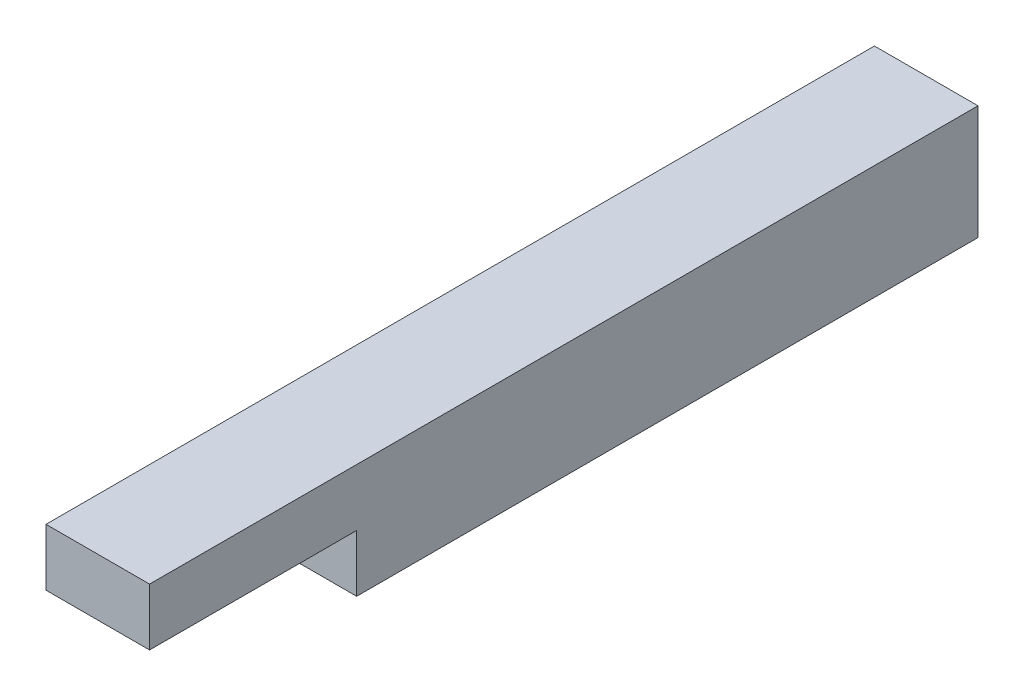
ISO-10303-21;
HEADER;
FILE_DESCRIPTION(('STEP AP214'),'2;1');
FILE_NAME('part.step','',(''),(''),'','','');
FILE_SCHEMA(('AUTOMOTIVE_DESIGN { 1 0 10303 214 1 1 1 1 }'));
ENDSEC;
DATA;
#1=APPLICATION_CONTEXT('core data for automotive mechanical design processes');
#2=APPLICATION_PROTOCOL_DEFINITION('international standard','automotive_design',2000,#1);
#3=PRODUCT_CONTEXT('',#1,'mechanical');
#4=PRODUCT('Part','Part','',(#3));
#5=PRODUCT_RELATED_PRODUCT_CATEGORY('part','',(#4));
#6=PRODUCT_DEFINITION_FORMATION('','',#4);
#7=PRODUCT_DEFINITION_CONTEXT('part definition',#1,'design');
#8=PRODUCT_DEFINITION('design','',#6,#7);
#9=PRODUCT_DEFINITION_SHAPE('','',#8);
#10=(LENGTH_UNIT() NAMED_UNIT(*) SI_UNIT(.MILLI.,.METRE.));
#11=(NAMED_UNIT(*) PLANE_ANGLE_UNIT() SI_UNIT($,.RADIAN.));
#12=(NAMED_UNIT(*) SI_UNIT($,.STERADIAN.) SOLID_ANGLE_UNIT());
#13=UNCERTAINTY_MEASURE_WITH_UNIT(LENGTH_MEASURE(1.E-05),#10,'distance_accuracy_value','');
#14=(GEOMETRIC_REPRESENTATION_CONTEXT(3) GLOBAL_UNCERTAINTY_ASSIGNED_CONTEXT((#13)) GLOBAL_UNIT_ASSIGNED_CONTEXT((#10,
#11,#12)) REPRESENTATION_CONTEXT('',''));
#15=CARTESIAN_POINT('',(0.,0.,0.));
#16=DIRECTION('',(0.,0.,1.));
#17=DIRECTION('',(1.,0.,0.));
#18=AXIS2_PLACEMENT_3D('',#15,#16,#17);
#19=CARTESIAN_POINT('',(6.35,0.,0.));
#20=DIRECTION('',(0.,0.,1.));
#21=DIRECTION('',(1.,0.,0.));
#22=AXIS2_PLACEMENT_3D('',#19,#20,#21);
#23=PLANE('',#22);
#24=DIRECTION('',(0.,1.,0.));
#25=VECTOR('',#24,1.);
#26=CARTESIAN_POINT('',(0.,0.,0.));
#27=LINE('',#26,#25);
#28=CARTESIAN_POINT('',(0.,0.,0.));
#29=VERTEX_POINT('',#28);
#30=CARTESIAN_POINT('',(0.,7.,0.));
#31=VERTEX_POINT('',#30);
#32=EDGE_CURVE('E117',#29,#31,#27,.T.);
#33=ORIENTED_EDGE('',*,*,#32,.T.);
#34=DIRECTION('',(-1.,0.,0.));
#35=VECTOR('',#34,1.);
#36=CARTESIAN_POINT('',(6.35,7.,0.));
#37=LINE('',#36,#35);
#38=CARTESIAN_POINT('',(6.35,7.,0.));
#39=VERTEX_POINT('',#38);
#40=EDGE_CURVE('E11',#39,#31,#37,.T.);
#41=ORIENTED_EDGE('',*,*,#40,.F.);
#42=DIRECTION('',(0.,1.,0.));
#43=VECTOR('',#42,1.);
#44=CARTESIAN_POINT('',(6.35,0.,0.));
#45=LINE('',#44,#43);
#46=CARTESIAN_POINT('',(6.35,0.,0.));
#47=VERTEX_POINT('',#46);
#48=EDGE_CURVE('E127',#47,#39,#45,.T.);
#49=ORIENTED_EDGE('',*,*,#48,.F.);
#50=DIRECTION('',(-1.,0.,0.));
#51=VECTOR('',#50,1.);
#52=CARTESIAN_POINT('',(6.35,0.,0.));
#53=LINE('',#52,#51);
#54=EDGE_CURVE('E113',#47,#29,#53,.T.);
#55=ORIENTED_EDGE('',*,*,#54,.T.);
#56=EDGE_LOOP('',(#33,#41,#49,#55));
#57=FACE_BOUND('',#56,.T.);
#58=ADVANCED_FACE('F33',(#57),#23,.F.);
#59=CARTESIAN_POINT('',(6.35,7.,50.8));
#60=DIRECTION('',(0.,-1.,0.));
#61=DIRECTION('',(0.,0.,-1.));
#62=AXIS2_PLACEMENT_3D('',#59,#60,#61);
#63=PLANE('',#62);
#64=DIRECTION('',(0.,0.,1.));
#65=VECTOR('',#64,1.);
#66=CARTESIAN_POINT('',(0.,7.,50.8));
#67=LINE('',#66,#65);
#68=CARTESIAN_POINT('',(0.,7.,50.8));
#69=VERTEX_POINT('',#68);
#70=EDGE_CURVE('E120',#31,#69,#67,.T.);
#71=ORIENTED_EDGE('',*,*,#70,.T.);
#72=DIRECTION('',(-1.,0.,0.));
#73=VECTOR('',#72,1.);
#74=CARTESIAN_POINT('',(6.35,7.,50.8));
#75=LINE('',#74,#73);
#76=CARTESIAN_POINT('',(6.35,7.,50.8));
#77=VERTEX_POINT('',#76);
#78=EDGE_CURVE('E41',#77,#69,#75,.T.);
#79=ORIENTED_EDGE('',*,*,#78,.F.);
#80=DIRECTION('',(0.,0.,1.));
#81=VECTOR('',#80,1.);
#82=CARTESIAN_POINT('',(6.35,7.,50.8));
#83=LINE('',#82,#81);
#84=EDGE_CURVE('E86',#39,#77,#83,.T.);
#85=ORIENTED_EDGE('',*,*,#84,.F.);
#86=ORIENTED_EDGE('',*,*,#40,.T.);
#87=EDGE_LOOP('',(#71,#79,#85,#86));
#88=FACE_BOUND('',#87,.T.);
#89=ADVANCED_FACE('F151',(#88),#63,.F.);
#90=CARTESIAN_POINT('',(6.35,7.,50.8));
#91=DIRECTION('',(0.,0.,-1.));
#92=DIRECTION('',(-1.,0.,0.));
#93=AXIS2_PLACEMENT_3D('',#90,#91,#92);
#94=PLANE('',#93);
#95=DIRECTION('',(0.,-1.,0.));
#96=VECTOR('',#95,1.);
#97=CARTESIAN_POINT('',(0.,7.,50.8));
#98=LINE('',#97,#96);
#99=CARTESIAN_POINT('',(0.,3.5,50.8));
#100=VERTEX_POINT('',#99);
#101=EDGE_CURVE('E122',#69,#100,#98,.T.);
#102=ORIENTED_EDGE('',*,*,#101,.T.);
#103=DIRECTION('',(-1.,0.,0.));
#104=VECTOR('',#103,1.);
#105=CARTESIAN_POINT('',(6.35,3.5,50.8));
#106=LINE('',#105,#104);
#107=CARTESIAN_POINT('',(6.35,3.5,50.8));
#108=VERTEX_POINT('',#107);
#109=EDGE_CURVE('E108',#108,#100,#106,.T.);
#110=ORIENTED_EDGE('',*,*,#109,.F.);
#111=DIRECTION('',(0.,-1.,0.));
#112=VECTOR('',#111,1.);
#113=CARTESIAN_POINT('',(6.35,7.,50.8));
#114=LINE('',#113,#112);
#115=EDGE_CURVE('E99',#77,#108,#114,.T.);
#116=ORIENTED_EDGE('',*,*,#115,.F.);
#117=ORIENTED_EDGE('',*,*,#78,.T.);
#118=EDGE_LOOP('',(#102,#110,#116,#117));
#119=FACE_BOUND('',#118,.T.);
#120=ADVANCED_FACE('F133',(#119),#94,.F.);
#121=CARTESIAN_POINT('',(6.35,3.5,50.8));
#122=DIRECTION('',(0.,1.,0.));
#123=DIRECTION('',(0.,0.,1.));
#124=AXIS2_PLACEMENT_3D('',#121,#122,#123);
#125=PLANE('',#124);
#126=DIRECTION('',(0.,0.,-1.));
#127=VECTOR('',#126,1.);
#128=CARTESIAN_POINT('',(0.,3.5,50.8));
#129=LINE('',#128,#127);
#130=CARTESIAN_POINT('',(0.,3.5,38.1));
#131=VERTEX_POINT('',#130);
#132=EDGE_CURVE('E107',#100,#131,#129,.T.);
#133=ORIENTED_EDGE('',*,*,#132,.T.);
#134=DIRECTION('',(-1.,0.,0.));
#135=VECTOR('',#134,1.);
#136=CARTESIAN_POINT('',(6.35,3.5,38.1));
#137=LINE('',#136,#135);
#138=CARTESIAN_POINT('',(6.35,3.5,38.1));
#139=VERTEX_POINT('',#138);
#140=EDGE_CURVE('E104',#139,#131,#137,.T.);
#141=ORIENTED_EDGE('',*,*,#140,.F.);
#142=DIRECTION('',(0.,0.,-1.));
#143=VECTOR('',#142,1.);
#144=CARTESIAN_POINT('',(6.35,3.5,50.8));
#145=LINE('',#144,#143);
#146=EDGE_CURVE('E93',#108,#139,#145,.T.);
#147=ORIENTED_EDGE('',*,*,#146,.F.);
#148=ORIENTED_EDGE('',*,*,#109,.T.);
#149=EDGE_LOOP('',(#133,#141,#147,#148));
#150=FACE_BOUND('',#149,.T.);
#151=ADVANCED_FACE('F105',(#150),#125,.F.);
#152=CARTESIAN_POINT('',(6.35,0.,38.1));
#153=DIRECTION('',(0.,0.,-1.));
#154=DIRECTION('',(-1.,0.,0.));
#155=AXIS2_PLACEMENT_3D('',#152,#153,#154);
#156=PLANE('',#155);
#157=DIRECTION('',(0.,-1.,0.));
#158=VECTOR('',#157,1.);
#159=CARTESIAN_POINT('',(0.,0.,38.1));
#160=LINE('',#159,#158);
#161=CARTESIAN_POINT('',(0.,0.,38.1));
#162=VERTEX_POINT('',#161);
#163=EDGE_CURVE('E72',#131,#162,#160,.T.);
#164=ORIENTED_EDGE('',*,*,#163,.T.);
#165=DIRECTION('',(-1.,0.,0.));
#166=VECTOR('',#165,1.);
#167=CARTESIAN_POINT('',(6.35,0.,38.1));
#168=LINE('',#167,#166);
#169=CARTESIAN_POINT('',(6.35,0.,38.1));
#170=VERTEX_POINT('',#169);
#171=EDGE_CURVE('E109',#170,#162,#168,.T.);
#172=ORIENTED_EDGE('',*,*,#171,.F.);
#173=DIRECTION('',(0.,-1.,0.));
#174=VECTOR('',#173,1.);
#175=CARTESIAN_POINT('',(6.35,0.,38.1));
#176=LINE('',#175,#174);
#177=EDGE_CURVE('E97',#139,#170,#176,.T.);
#178=ORIENTED_EDGE('',*,*,#177,.F.);
#179=ORIENTED_EDGE('',*,*,#140,.T.);
#180=EDGE_LOOP('',(#164,#172,#178,#179));
#181=FACE_BOUND('',#180,.T.);
#182=ADVANCED_FACE('F111',(#181),#156,.F.);
#183=CARTESIAN_POINT('',(6.35,0.,0.));
#184=DIRECTION('',(0.,1.,0.));
#185=DIRECTION('',(0.,0.,1.));
#186=AXIS2_PLACEMENT_3D('',#183,#184,#185);
#187=PLANE('',#186);
#188=DIRECTION('',(0.,0.,-1.));
#189=VECTOR('',#188,1.);
#190=CARTESIAN_POINT('',(0.,0.,0.));
#191=LINE('',#190,#189);
#192=EDGE_CURVE('E78',#162,#29,#191,.T.);
#193=ORIENTED_EDGE('',*,*,#192,.T.);
#194=ORIENTED_EDGE('',*,*,#54,.F.);
#195=DIRECTION('',(0.,0.,-1.));
#196=VECTOR('',#195,1.);
#197=CARTESIAN_POINT('',(6.35,0.,0.));
#198=LINE('',#197,#196);
#199=EDGE_CURVE('E49',#170,#47,#198,.T.);
#200=ORIENTED_EDGE('',*,*,#199,.F.);
#201=ORIENTED_EDGE('',*,*,#171,.T.);
#202=EDGE_LOOP('',(#193,#194,#200,#201));
#203=FACE_BOUND('',#202,.T.);
#204=ADVANCED_FACE('F140',(#203),#187,.F.);
#205=CARTESIAN_POINT('',(6.35,0.,0.));
#206=DIRECTION('',(-1.,0.,0.));
#207=DIRECTION('',(0.,0.,1.));
#208=AXIS2_PLACEMENT_3D('',#205,#206,#207);
#209=PLANE('',#208);
#210=ORIENTED_EDGE('',*,*,#48,.T.);
#211=ORIENTED_EDGE('',*,*,#84,.T.);
#212=ORIENTED_EDGE('',*,*,#115,.T.);
#213=ORIENTED_EDGE('',*,*,#146,.T.);
#214=ORIENTED_EDGE('',*,*,#177,.T.);
#215=ORIENTED_EDGE('',*,*,#199,.T.);
#216=EDGE_LOOP('',(#210,#211,#212,#213,#214,#215));
#217=FACE_BOUND('',#216,.T.);
#218=ADVANCED_FACE('F95',(#217),#209,.F.);
#219=CARTESIAN_POINT('',(0.,0.,0.));
#220=DIRECTION('',(-1.,0.,0.));
#221=DIRECTION('',(0.,0.,1.));
#222=AXIS2_PLACEMENT_3D('',#219,#220,#221);
#223=PLANE('',#222);
#224=ORIENTED_EDGE('',*,*,#32,.F.);
#225=ORIENTED_EDGE('',*,*,#192,.F.);
#226=ORIENTED_EDGE('',*,*,#163,.F.);
#227=ORIENTED_EDGE('',*,*,#132,.F.);
#228=ORIENTED_EDGE('',*,*,#101,.F.);
#229=ORIENTED_EDGE('',*,*,#70,.F.);
#230=EDGE_LOOP('',(#224,#225,#226,#227,#228,#229));
#231=FACE_BOUND('',#230,.T.);
#232=ADVANCED_FACE('F136',(#231),#223,.T.);
#233=CLOSED_SHELL('',(#58,#89,#120,#151,#182,#204,#218,#232));
#234=MANIFOLD_SOLID_BREP('B2',#233);
#235=ADVANCED_BREP_SHAPE_REPRESENTATION('',(#18,#234),#14);
#236=SHAPE_DEFINITION_REPRESENTATION(#9,#235);
ENDSEC;
END-ISO-10303-21;
